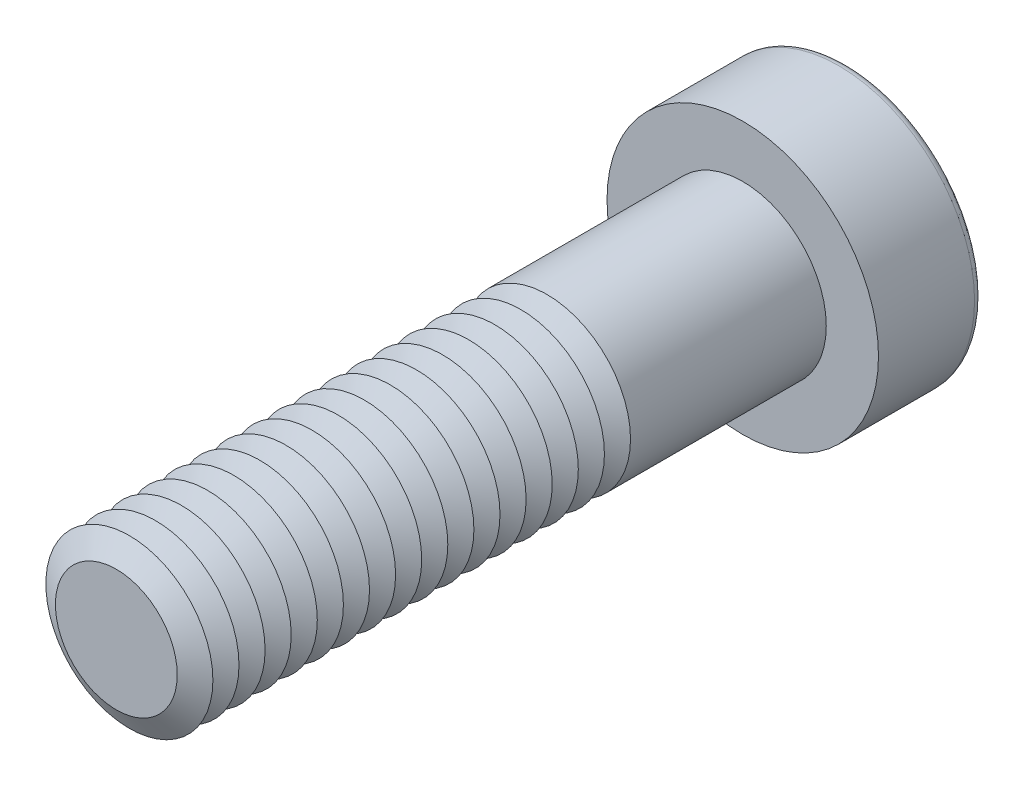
from build123d import *

# Parameters (mm, degrees)
SKETCH1_R           = 4
BOSS_EXTRUDE1_DEPTH = 30
SKETCH2_R           = 6.5
BOSS_EXTRUDE2_DEPTH = 5
CUT_EXTRUDE1_DEPTH  = 3.75
FILLET1_R           = 0.4
LPATTERN1_COUNT     = 17
LPATTERN1_PITCH     = 1.25


with BuildPart() as part:
    # Sketch1 → Boss-Extrude1 (new body)
    with BuildSketch(Plane.XY):
        Circle(SKETCH1_R)
    extrude(amount=BOSS_EXTRUDE1_DEPTH)

    # Sketch2 → Boss-Extrude2 (add)
    with BuildSketch(Plane(origin=(0, 0, 0), x_dir=(-1, 0, 0), z_dir=(0, 0, -1))):
        Circle(SKETCH2_R)
    extrude(amount=BOSS_EXTRUDE2_DEPTH)

    # Sketch3 → Cut-Extrude1 (cut)
    with BuildSketch(Plane(origin=(0, 0, -5), x_dir=(-1, 0, 0), z_dir=(0, 0, -1))):
        Polygon((-1.443375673, 2.5), (-2.886751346, 0), (-1.443375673, -2.5), (1.443375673, -2.5), (2.886751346, 0), (1.443375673, 2.5), align=None)
    extrude(amount=-CUT_EXTRUDE1_DEPTH, mode=Mode.SUBTRACT)

    # Fillet1
    fillet1_edges = [part.edges().sort_by_distance(p)[0] for p in [
        (6.5, 0, -5),
    ]]
    fillet(fillet1_edges, radius=FILLET1_R)

    # Cut-Extrude2 cone 1 section (on through the dimple's axis) → Cut-Extrude2 (revolve, cut)
    with BuildSketch(Plane(origin=(0, 0, -1.25), x_dir=(0, 1, 0), z_dir=(1, 0, 0))):
        Polygon((0, 0), (2.5, 0), (0, 1.443375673), align=None)
    revolve(axis=Axis((0, 0, -1.25), (0, 0, 1)), mode=Mode.SUBTRACT)

    # Cut-Extrude3 cone 1 section (on through the dimple's axis) → Cut-Extrude3 (revolve, cut)
    with BuildSketch(Plane(origin=(0, 0, -5), x_dir=(0, 1, 0), z_dir=(1, 0, 0))):
        Polygon((0, 0), (2.886751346, 0), (0, 0.773502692), align=None)
    revolve(axis=Axis((0, 0, -5), (0, 0, 1)), mode=Mode.SUBTRACT)

    # Sketch7 → Cut-Revolve1 (revolve, cut)
    with BuildSketch(Plane(origin=(0, 0, 0), x_dir=(0, 0, -1), z_dir=(1, 0, 0)), mode=Mode.PRIVATE) as cut_revolve1_sk:
        Polygon((-30, 2.917468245), (-29.375, 4), (-30.625, 4), align=None)
    cut_revolve1 = revolve(cut_revolve1_sk.sketch.rotate(Axis((0, 0, 30), (0, 0, -1)), 90), axis=Axis((0, 0, 30), (0, 0, -1)), mode=Mode.SUBTRACT)

    # LPattern1: Cut-Revolve1 ×17
    with Locations(*[(0, 0, -i * LPATTERN1_PITCH) for i in range(1, LPATTERN1_COUNT)]):
        add(cut_revolve1, mode=Mode.SUBTRACT)


solid = part.part
